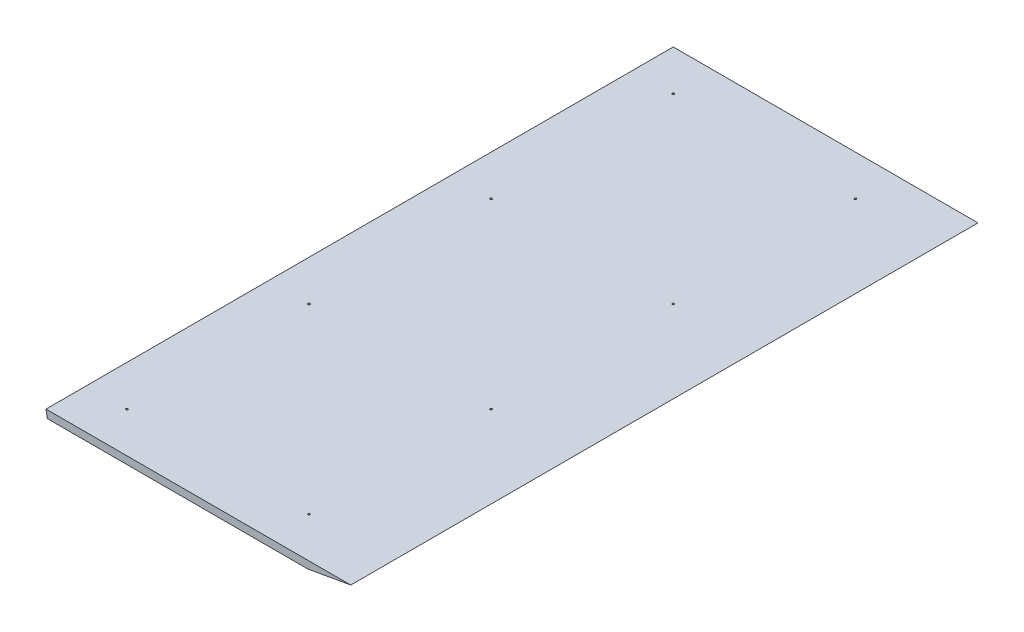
ISO-10303-21;
HEADER;
FILE_DESCRIPTION(('STEP AP214'),'2;1');
FILE_NAME('part.step','',(''),(''),'','','');
FILE_SCHEMA(('AUTOMOTIVE_DESIGN { 1 0 10303 214 1 1 1 1 }'));
ENDSEC;
DATA;
#1=APPLICATION_CONTEXT('core data for automotive mechanical design processes');
#2=APPLICATION_PROTOCOL_DEFINITION('international standard','automotive_design',2000,#1);
#3=PRODUCT_CONTEXT('',#1,'mechanical');
#4=PRODUCT('Part','Part','',(#3));
#5=PRODUCT_RELATED_PRODUCT_CATEGORY('part','',(#4));
#6=PRODUCT_DEFINITION_FORMATION('','',#4);
#7=PRODUCT_DEFINITION_CONTEXT('part definition',#1,'design');
#8=PRODUCT_DEFINITION('design','',#6,#7);
#9=PRODUCT_DEFINITION_SHAPE('','',#8);
#10=(LENGTH_UNIT() NAMED_UNIT(*) SI_UNIT(.MILLI.,.METRE.));
#11=(NAMED_UNIT(*) PLANE_ANGLE_UNIT() SI_UNIT($,.RADIAN.));
#12=(NAMED_UNIT(*) SI_UNIT($,.STERADIAN.) SOLID_ANGLE_UNIT());
#13=UNCERTAINTY_MEASURE_WITH_UNIT(LENGTH_MEASURE(1.E-05),#10,'distance_accuracy_value','');
#14=(GEOMETRIC_REPRESENTATION_CONTEXT(3) GLOBAL_UNCERTAINTY_ASSIGNED_CONTEXT((#13)) GLOBAL_UNIT_ASSIGNED_CONTEXT((#10,
#11,#12)) REPRESENTATION_CONTEXT('',''));
#15=CARTESIAN_POINT('',(0.,0.,0.));
#16=DIRECTION('',(0.,0.,1.));
#17=DIRECTION('',(1.,0.,0.));
#18=AXIS2_PLACEMENT_3D('',#15,#16,#17);
#19=CARTESIAN_POINT('',(0.,19.05,0.));
#20=DIRECTION('',(0.,0.,-1.));
#21=DIRECTION('',(-1.,0.,0.));
#22=AXIS2_PLACEMENT_3D('',#19,#20,#21);
#23=PLANE('',#22);
#24=DIRECTION('',(1.,0.,0.));
#25=VECTOR('',#24,1.);
#26=CARTESIAN_POINT('',(0.,0.,0.));
#27=LINE('',#26,#25);
#28=CARTESIAN_POINT('',(3.35902898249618,0.,0.));
#29=VERTEX_POINT('',#28);
#30=CARTESIAN_POINT('',(657.137081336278,0.,0.));
#31=VERTEX_POINT('',#30);
#32=EDGE_CURVE('E105',#29,#31,#27,.T.);
#33=ORIENTED_EDGE('',*,*,#32,.T.);
#34=DIRECTION('',(0.984807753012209,0.173648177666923,0.));
#35=VECTOR('',#34,1.);
#36=CARTESIAN_POINT('',(657.137081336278,0.,0.));
#37=LINE('',#36,#35);
#38=CARTESIAN_POINT('',(765.175,19.05,0.));
#39=VERTEX_POINT('',#38);
#40=EDGE_CURVE('E50',#31,#39,#37,.T.);
#41=ORIENTED_EDGE('',*,*,#40,.T.);
#42=DIRECTION('',(1.,0.,0.));
#43=VECTOR('',#42,1.);
#44=CARTESIAN_POINT('',(0.,19.05,0.));
#45=LINE('',#44,#43);
#46=CARTESIAN_POINT('',(0.,19.05,0.));
#47=VERTEX_POINT('',#46);
#48=EDGE_CURVE('E89',#47,#39,#45,.T.);
#49=ORIENTED_EDGE('',*,*,#48,.F.);
#50=DIRECTION('',(0.173648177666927,-0.984807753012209,0.));
#51=VECTOR('',#50,1.);
#52=CARTESIAN_POINT('',(0.,19.05,0.));
#53=LINE('',#52,#51);
#54=EDGE_CURVE('E92',#47,#29,#53,.T.);
#55=ORIENTED_EDGE('',*,*,#54,.T.);
#56=EDGE_LOOP('',(#33,#41,#49,#55));
#57=FACE_BOUND('',#56,.T.);
#58=ADVANCED_FACE('F34',(#57),#23,.F.);
#59=CARTESIAN_POINT('',(0.,19.05,-1574.8));
#60=DIRECTION('',(0.,0.,1.));
#61=DIRECTION('',(1.,0.,0.));
#62=AXIS2_PLACEMENT_3D('',#59,#60,#61);
#63=PLANE('',#62);
#64=DIRECTION('',(-1.,0.,0.));
#65=VECTOR('',#64,1.);
#66=CARTESIAN_POINT('',(0.,19.05,-1574.8));
#67=LINE('',#66,#65);
#68=CARTESIAN_POINT('',(765.175,19.05,-1574.8));
#69=VERTEX_POINT('',#68);
#70=CARTESIAN_POINT('',(0.,19.05,-1574.8));
#71=VERTEX_POINT('',#70);
#72=EDGE_CURVE('E11',#69,#71,#67,.T.);
#73=ORIENTED_EDGE('',*,*,#72,.F.);
#74=DIRECTION('',(0.984807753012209,0.173648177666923,0.));
#75=VECTOR('',#74,1.);
#76=CARTESIAN_POINT('',(657.137081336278,0.,-1574.8));
#77=LINE('',#76,#75);
#78=CARTESIAN_POINT('',(657.137081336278,0.,-1574.8));
#79=VERTEX_POINT('',#78);
#80=EDGE_CURVE('E74',#79,#69,#77,.T.);
#81=ORIENTED_EDGE('',*,*,#80,.F.);
#82=DIRECTION('',(-1.,0.,0.));
#83=VECTOR('',#82,1.);
#84=CARTESIAN_POINT('',(0.,0.,-1574.8));
#85=LINE('',#84,#83);
#86=CARTESIAN_POINT('',(3.35902898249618,0.,-1574.8));
#87=VERTEX_POINT('',#86);
#88=EDGE_CURVE('E37',#79,#87,#85,.T.);
#89=ORIENTED_EDGE('',*,*,#88,.T.);
#90=DIRECTION('',(0.173648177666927,-0.984807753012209,0.));
#91=VECTOR('',#90,1.);
#92=CARTESIAN_POINT('',(0.,19.05,-1574.8));
#93=LINE('',#92,#91);
#94=EDGE_CURVE('E58',#71,#87,#93,.T.);
#95=ORIENTED_EDGE('',*,*,#94,.F.);
#96=EDGE_LOOP('',(#73,#81,#89,#95));
#97=FACE_BOUND('',#96,.T.);
#98=ADVANCED_FACE('F91',(#97),#63,.F.);
#99=CARTESIAN_POINT('',(0.,19.05,0.));
#100=DIRECTION('',(0.,-1.,0.));
#101=DIRECTION('',(0.,0.,-1.));
#102=AXIS2_PLACEMENT_3D('',#99,#100,#101);
#103=PLANE('',#102);
#104=CARTESIAN_POINT('',(101.6,19.05,-1473.2));
#105=DIRECTION('',(0.,1.,0.));
#106=DIRECTION('',(0.,0.,1.));
#107=AXIS2_PLACEMENT_3D('',#104,#105,#106);
#108=CIRCLE('',#107,2.52729999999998);
#109=CARTESIAN_POINT('',(101.6,19.05,-1470.6727));
#110=VERTEX_POINT('',#109);
#111=EDGE_CURVE('E152',#110,#110,#108,.T.);
#112=ORIENTED_EDGE('',*,*,#111,.F.);
#113=EDGE_LOOP('',(#112));
#114=FACE_BOUND('',#113,.T.);
#115=CARTESIAN_POINT('',(558.8,19.05,-1473.2));
#116=DIRECTION('',(0.,1.,0.));
#117=DIRECTION('',(0.,0.,1.));
#118=AXIS2_PLACEMENT_3D('',#115,#116,#117);
#119=CIRCLE('',#118,2.52730000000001);
#120=CARTESIAN_POINT('',(558.8,19.05,-1470.6727));
#121=VERTEX_POINT('',#120);
#122=EDGE_CURVE('E146',#121,#121,#119,.T.);
#123=ORIENTED_EDGE('',*,*,#122,.F.);
#124=EDGE_LOOP('',(#123));
#125=FACE_BOUND('',#124,.T.);
#126=CARTESIAN_POINT('',(558.8,19.05,-1016.));
#127=DIRECTION('',(0.,1.,0.));
#128=DIRECTION('',(0.,0.,1.));
#129=AXIS2_PLACEMENT_3D('',#126,#127,#128);
#130=CIRCLE('',#129,2.52730000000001);
#131=CARTESIAN_POINT('',(558.8,19.05,-1013.4727));
#132=VERTEX_POINT('',#131);
#133=EDGE_CURVE('E140',#132,#132,#130,.T.);
#134=ORIENTED_EDGE('',*,*,#133,.F.);
#135=EDGE_LOOP('',(#134));
#136=FACE_BOUND('',#135,.T.);
#137=CARTESIAN_POINT('',(558.8,19.05,-558.8));
#138=DIRECTION('',(0.,1.,0.));
#139=DIRECTION('',(0.,0.,1.));
#140=AXIS2_PLACEMENT_3D('',#137,#138,#139);
#141=CIRCLE('',#140,2.52730000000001);
#142=CARTESIAN_POINT('',(558.8,19.05,-556.2727));
#143=VERTEX_POINT('',#142);
#144=EDGE_CURVE('E134',#143,#143,#141,.T.);
#145=ORIENTED_EDGE('',*,*,#144,.F.);
#146=EDGE_LOOP('',(#145));
#147=FACE_BOUND('',#146,.T.);
#148=CARTESIAN_POINT('',(558.8,19.05,-101.6));
#149=DIRECTION('',(0.,1.,0.));
#150=DIRECTION('',(0.,0.,1.));
#151=AXIS2_PLACEMENT_3D('',#148,#149,#150);
#152=CIRCLE('',#151,2.52730000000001);
#153=CARTESIAN_POINT('',(558.8,19.05,-99.0727));
#154=VERTEX_POINT('',#153);
#155=EDGE_CURVE('E128',#154,#154,#152,.T.);
#156=ORIENTED_EDGE('',*,*,#155,.F.);
#157=EDGE_LOOP('',(#156));
#158=FACE_BOUND('',#157,.T.);
#159=CARTESIAN_POINT('',(101.6,19.05,-101.6));
#160=DIRECTION('',(0.,1.,0.));
#161=DIRECTION('',(0.,0.,1.));
#162=AXIS2_PLACEMENT_3D('',#159,#160,#161);
#163=CIRCLE('',#162,2.52729999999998);
#164=CARTESIAN_POINT('',(101.6,19.05,-99.0727));
#165=VERTEX_POINT('',#164);
#166=EDGE_CURVE('E122',#165,#165,#163,.T.);
#167=ORIENTED_EDGE('',*,*,#166,.F.);
#168=EDGE_LOOP('',(#167));
#169=FACE_BOUND('',#168,.T.);
#170=CARTESIAN_POINT('',(101.6,19.05,-558.8));
#171=DIRECTION('',(0.,1.,0.));
#172=DIRECTION('',(0.,0.,1.));
#173=AXIS2_PLACEMENT_3D('',#170,#171,#172);
#174=CIRCLE('',#173,2.52729999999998);
#175=CARTESIAN_POINT('',(101.6,19.05,-556.2727));
#176=VERTEX_POINT('',#175);
#177=EDGE_CURVE('E116',#176,#176,#174,.T.);
#178=ORIENTED_EDGE('',*,*,#177,.F.);
#179=EDGE_LOOP('',(#178));
#180=FACE_BOUND('',#179,.T.);
#181=CARTESIAN_POINT('',(101.6,19.05,-1016.));
#182=DIRECTION('',(0.,1.,0.));
#183=DIRECTION('',(0.,0.,1.));
#184=AXIS2_PLACEMENT_3D('',#181,#182,#183);
#185=CIRCLE('',#184,2.52729999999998);
#186=CARTESIAN_POINT('',(101.6,19.05,-1013.4727));
#187=VERTEX_POINT('',#186);
#188=EDGE_CURVE('E98',#187,#187,#185,.T.);
#189=ORIENTED_EDGE('',*,*,#188,.F.);
#190=EDGE_LOOP('',(#189));
#191=FACE_BOUND('',#190,.T.);
#192=DIRECTION('',(0.,0.,1.));
#193=VECTOR('',#192,1.);
#194=CARTESIAN_POINT('',(0.,19.05,0.));
#195=LINE('',#194,#193);
#196=EDGE_CURVE('E103',#71,#47,#195,.T.);
#197=ORIENTED_EDGE('',*,*,#196,.T.);
#198=ORIENTED_EDGE('',*,*,#48,.T.);
#199=DIRECTION('',(0.,0.,-1.));
#200=VECTOR('',#199,1.);
#201=CARTESIAN_POINT('',(765.175,19.05,0.));
#202=LINE('',#201,#200);
#203=EDGE_CURVE('E42',#39,#69,#202,.T.);
#204=ORIENTED_EDGE('',*,*,#203,.T.);
#205=ORIENTED_EDGE('',*,*,#72,.T.);
#206=EDGE_LOOP('',(#197,#198,#204,#205));
#207=FACE_BOUND('',#206,.T.);
#208=ADVANCED_FACE('F87',(#114,#125,#136,#147,#158,#169,#180,#191,#207),#103,.F.);
#209=CARTESIAN_POINT('',(0.,0.,0.));
#210=DIRECTION('',(0.,-1.,0.));
#211=DIRECTION('',(0.,0.,-1.));
#212=AXIS2_PLACEMENT_3D('',#209,#210,#211);
#213=PLANE('',#212);
#214=CARTESIAN_POINT('',(101.6,0.,-1473.2));
#215=DIRECTION('',(0.,1.,0.));
#216=DIRECTION('',(0.,0.,1.));
#217=AXIS2_PLACEMENT_3D('',#214,#215,#216);
#218=CIRCLE('',#217,2.52729999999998);
#219=CARTESIAN_POINT('',(101.6,0.,-1470.6727));
#220=VERTEX_POINT('',#219);
#221=EDGE_CURVE('E149',#220,#220,#218,.T.);
#222=ORIENTED_EDGE('',*,*,#221,.T.);
#223=EDGE_LOOP('',(#222));
#224=FACE_BOUND('',#223,.T.);
#225=CARTESIAN_POINT('',(558.8,0.,-1473.2));
#226=DIRECTION('',(0.,1.,0.));
#227=DIRECTION('',(0.,0.,1.));
#228=AXIS2_PLACEMENT_3D('',#225,#226,#227);
#229=CIRCLE('',#228,2.52730000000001);
#230=CARTESIAN_POINT('',(558.8,0.,-1470.6727));
#231=VERTEX_POINT('',#230);
#232=EDGE_CURVE('E143',#231,#231,#229,.T.);
#233=ORIENTED_EDGE('',*,*,#232,.T.);
#234=EDGE_LOOP('',(#233));
#235=FACE_BOUND('',#234,.T.);
#236=CARTESIAN_POINT('',(558.8,0.,-1016.));
#237=DIRECTION('',(0.,1.,0.));
#238=DIRECTION('',(0.,0.,1.));
#239=AXIS2_PLACEMENT_3D('',#236,#237,#238);
#240=CIRCLE('',#239,2.52730000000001);
#241=CARTESIAN_POINT('',(558.8,0.,-1013.4727));
#242=VERTEX_POINT('',#241);
#243=EDGE_CURVE('E137',#242,#242,#240,.T.);
#244=ORIENTED_EDGE('',*,*,#243,.T.);
#245=EDGE_LOOP('',(#244));
#246=FACE_BOUND('',#245,.T.);
#247=CARTESIAN_POINT('',(558.8,0.,-558.8));
#248=DIRECTION('',(0.,1.,0.));
#249=DIRECTION('',(0.,0.,1.));
#250=AXIS2_PLACEMENT_3D('',#247,#248,#249);
#251=CIRCLE('',#250,2.52730000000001);
#252=CARTESIAN_POINT('',(558.8,0.,-556.2727));
#253=VERTEX_POINT('',#252);
#254=EDGE_CURVE('E131',#253,#253,#251,.T.);
#255=ORIENTED_EDGE('',*,*,#254,.T.);
#256=EDGE_LOOP('',(#255));
#257=FACE_BOUND('',#256,.T.);
#258=CARTESIAN_POINT('',(558.8,0.,-101.6));
#259=DIRECTION('',(0.,1.,0.));
#260=DIRECTION('',(0.,0.,1.));
#261=AXIS2_PLACEMENT_3D('',#258,#259,#260);
#262=CIRCLE('',#261,2.52730000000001);
#263=CARTESIAN_POINT('',(558.8,0.,-99.0727));
#264=VERTEX_POINT('',#263);
#265=EDGE_CURVE('E125',#264,#264,#262,.T.);
#266=ORIENTED_EDGE('',*,*,#265,.T.);
#267=EDGE_LOOP('',(#266));
#268=FACE_BOUND('',#267,.T.);
#269=CARTESIAN_POINT('',(101.6,0.,-101.6));
#270=DIRECTION('',(0.,1.,0.));
#271=DIRECTION('',(0.,0.,1.));
#272=AXIS2_PLACEMENT_3D('',#269,#270,#271);
#273=CIRCLE('',#272,2.52729999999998);
#274=CARTESIAN_POINT('',(101.6,0.,-99.0727));
#275=VERTEX_POINT('',#274);
#276=EDGE_CURVE('E119',#275,#275,#273,.T.);
#277=ORIENTED_EDGE('',*,*,#276,.T.);
#278=EDGE_LOOP('',(#277));
#279=FACE_BOUND('',#278,.T.);
#280=CARTESIAN_POINT('',(101.6,0.,-558.8));
#281=DIRECTION('',(0.,1.,0.));
#282=DIRECTION('',(0.,0.,1.));
#283=AXIS2_PLACEMENT_3D('',#280,#281,#282);
#284=CIRCLE('',#283,2.52729999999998);
#285=CARTESIAN_POINT('',(101.6,0.,-556.2727));
#286=VERTEX_POINT('',#285);
#287=EDGE_CURVE('E113',#286,#286,#284,.T.);
#288=ORIENTED_EDGE('',*,*,#287,.T.);
#289=EDGE_LOOP('',(#288));
#290=FACE_BOUND('',#289,.T.);
#291=CARTESIAN_POINT('',(101.6,0.,-1016.));
#292=DIRECTION('',(0.,1.,0.));
#293=DIRECTION('',(0.,0.,1.));
#294=AXIS2_PLACEMENT_3D('',#291,#292,#293);
#295=CIRCLE('',#294,2.52729999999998);
#296=CARTESIAN_POINT('',(101.6,0.,-1013.4727));
#297=VERTEX_POINT('',#296);
#298=EDGE_CURVE('E93',#297,#297,#295,.T.);
#299=ORIENTED_EDGE('',*,*,#298,.T.);
#300=EDGE_LOOP('',(#299));
#301=FACE_BOUND('',#300,.T.);
#302=DIRECTION('',(0.,0.,-1.));
#303=VECTOR('',#302,1.);
#304=CARTESIAN_POINT('',(657.137081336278,0.,0.));
#305=LINE('',#304,#303);
#306=EDGE_CURVE('E77',#31,#79,#305,.T.);
#307=ORIENTED_EDGE('',*,*,#306,.F.);
#308=ORIENTED_EDGE('',*,*,#32,.F.);
#309=DIRECTION('',(0.,0.,-1.));
#310=VECTOR('',#309,1.);
#311=CARTESIAN_POINT('',(3.35902898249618,0.,0.));
#312=LINE('',#311,#310);
#313=EDGE_CURVE('E82',#29,#87,#312,.T.);
#314=ORIENTED_EDGE('',*,*,#313,.T.);
#315=ORIENTED_EDGE('',*,*,#88,.F.);
#316=EDGE_LOOP('',(#307,#308,#314,#315));
#317=FACE_BOUND('',#316,.T.);
#318=ADVANCED_FACE('F160',(#224,#235,#246,#257,#268,#279,#290,#301,#317),#213,.T.);
#319=CARTESIAN_POINT('',(0.,19.05,0.));
#320=DIRECTION('',(0.984807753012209,0.173648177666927,0.));
#321=DIRECTION('',(-0.173648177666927,0.984807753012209,0.));
#322=AXIS2_PLACEMENT_3D('',#319,#320,#321);
#323=PLANE('',#322);
#324=ORIENTED_EDGE('',*,*,#94,.T.);
#325=ORIENTED_EDGE('',*,*,#313,.F.);
#326=ORIENTED_EDGE('',*,*,#54,.F.);
#327=ORIENTED_EDGE('',*,*,#196,.F.);
#328=EDGE_LOOP('',(#324,#325,#326,#327));
#329=FACE_BOUND('',#328,.T.);
#330=ADVANCED_FACE('F188',(#329),#323,.F.);
#331=CARTESIAN_POINT('',(657.137081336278,0.,0.));
#332=DIRECTION('',(-0.173648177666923,0.984807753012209,0.));
#333=DIRECTION('',(-0.984807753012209,-0.173648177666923,0.));
#334=AXIS2_PLACEMENT_3D('',#331,#332,#333);
#335=PLANE('',#334);
#336=ORIENTED_EDGE('',*,*,#80,.T.);
#337=ORIENTED_EDGE('',*,*,#203,.F.);
#338=ORIENTED_EDGE('',*,*,#40,.F.);
#339=ORIENTED_EDGE('',*,*,#306,.T.);
#340=EDGE_LOOP('',(#336,#337,#338,#339));
#341=FACE_BOUND('',#340,.T.);
#342=ADVANCED_FACE('F76',(#341),#335,.F.);
#343=CARTESIAN_POINT('',(101.6,19.05,-1016.));
#344=DIRECTION('',(0.,1.,0.));
#345=DIRECTION('',(0.,0.,1.));
#346=AXIS2_PLACEMENT_3D('',#343,#344,#345);
#347=CYLINDRICAL_SURFACE('',#346,2.52729999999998);
#348=ORIENTED_EDGE('',*,*,#298,.F.);
#349=EDGE_LOOP('',(#348));
#350=FACE_BOUND('',#349,.T.);
#351=ORIENTED_EDGE('',*,*,#188,.T.);
#352=EDGE_LOOP('',(#351));
#353=FACE_BOUND('',#352,.T.);
#354=ADVANCED_FACE('F176',(#350,#353),#347,.F.);
#355=CARTESIAN_POINT('',(101.6,19.05,-558.8));
#356=DIRECTION('',(0.,1.,0.));
#357=DIRECTION('',(0.,0.,1.));
#358=AXIS2_PLACEMENT_3D('',#355,#356,#357);
#359=CYLINDRICAL_SURFACE('',#358,2.52729999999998);
#360=ORIENTED_EDGE('',*,*,#287,.F.);
#361=EDGE_LOOP('',(#360));
#362=FACE_BOUND('',#361,.T.);
#363=ORIENTED_EDGE('',*,*,#177,.T.);
#364=EDGE_LOOP('',(#363));
#365=FACE_BOUND('',#364,.T.);
#366=ADVANCED_FACE('F178',(#362,#365),#359,.F.);
#367=CARTESIAN_POINT('',(101.6,19.05,-101.6));
#368=DIRECTION('',(0.,1.,0.));
#369=DIRECTION('',(0.,0.,1.));
#370=AXIS2_PLACEMENT_3D('',#367,#368,#369);
#371=CYLINDRICAL_SURFACE('',#370,2.52729999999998);
#372=ORIENTED_EDGE('',*,*,#276,.F.);
#373=EDGE_LOOP('',(#372));
#374=FACE_BOUND('',#373,.T.);
#375=ORIENTED_EDGE('',*,*,#166,.T.);
#376=EDGE_LOOP('',(#375));
#377=FACE_BOUND('',#376,.T.);
#378=ADVANCED_FACE('F185',(#374,#377),#371,.F.);
#379=CARTESIAN_POINT('',(558.8,19.05,-101.6));
#380=DIRECTION('',(0.,1.,0.));
#381=DIRECTION('',(0.,0.,1.));
#382=AXIS2_PLACEMENT_3D('',#379,#380,#381);
#383=CYLINDRICAL_SURFACE('',#382,2.52730000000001);
#384=ORIENTED_EDGE('',*,*,#265,.F.);
#385=EDGE_LOOP('',(#384));
#386=FACE_BOUND('',#385,.T.);
#387=ORIENTED_EDGE('',*,*,#155,.T.);
#388=EDGE_LOOP('',(#387));
#389=FACE_BOUND('',#388,.T.);
#390=ADVANCED_FACE('F240',(#386,#389),#383,.F.);
#391=CARTESIAN_POINT('',(558.8,19.05,-558.8));
#392=DIRECTION('',(0.,1.,0.));
#393=DIRECTION('',(0.,0.,1.));
#394=AXIS2_PLACEMENT_3D('',#391,#392,#393);
#395=CYLINDRICAL_SURFACE('',#394,2.52730000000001);
#396=ORIENTED_EDGE('',*,*,#254,.F.);
#397=EDGE_LOOP('',(#396));
#398=FACE_BOUND('',#397,.T.);
#399=ORIENTED_EDGE('',*,*,#144,.T.);
#400=EDGE_LOOP('',(#399));
#401=FACE_BOUND('',#400,.T.);
#402=ADVANCED_FACE('F250',(#398,#401),#395,.F.);
#403=CARTESIAN_POINT('',(558.8,19.05,-1016.));
#404=DIRECTION('',(0.,1.,0.));
#405=DIRECTION('',(0.,0.,1.));
#406=AXIS2_PLACEMENT_3D('',#403,#404,#405);
#407=CYLINDRICAL_SURFACE('',#406,2.52730000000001);
#408=ORIENTED_EDGE('',*,*,#243,.F.);
#409=EDGE_LOOP('',(#408));
#410=FACE_BOUND('',#409,.T.);
#411=ORIENTED_EDGE('',*,*,#133,.T.);
#412=EDGE_LOOP('',(#411));
#413=FACE_BOUND('',#412,.T.);
#414=ADVANCED_FACE('F260',(#410,#413),#407,.F.);
#415=CARTESIAN_POINT('',(558.8,19.05,-1473.2));
#416=DIRECTION('',(0.,1.,0.));
#417=DIRECTION('',(0.,0.,1.));
#418=AXIS2_PLACEMENT_3D('',#415,#416,#417);
#419=CYLINDRICAL_SURFACE('',#418,2.52730000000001);
#420=ORIENTED_EDGE('',*,*,#232,.F.);
#421=EDGE_LOOP('',(#420));
#422=FACE_BOUND('',#421,.T.);
#423=ORIENTED_EDGE('',*,*,#122,.T.);
#424=EDGE_LOOP('',(#423));
#425=FACE_BOUND('',#424,.T.);
#426=ADVANCED_FACE('F270',(#422,#425),#419,.F.);
#427=CARTESIAN_POINT('',(101.6,19.05,-1473.2));
#428=DIRECTION('',(0.,1.,0.));
#429=DIRECTION('',(0.,0.,1.));
#430=AXIS2_PLACEMENT_3D('',#427,#428,#429);
#431=CYLINDRICAL_SURFACE('',#430,2.52729999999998);
#432=ORIENTED_EDGE('',*,*,#221,.F.);
#433=EDGE_LOOP('',(#432));
#434=FACE_BOUND('',#433,.T.);
#435=ORIENTED_EDGE('',*,*,#111,.T.);
#436=EDGE_LOOP('',(#435));
#437=FACE_BOUND('',#436,.T.);
#438=ADVANCED_FACE('F156',(#434,#437),#431,.F.);
#439=CLOSED_SHELL('',(#58,#98,#208,#318,#330,#342,#354,#366,#378,#390,#402,#414,#426,#438));
#440=MANIFOLD_SOLID_BREP('B2',#439);
#441=ADVANCED_BREP_SHAPE_REPRESENTATION('',(#18,#440),#14);
#442=SHAPE_DEFINITION_REPRESENTATION(#9,#441);
ENDSEC;
END-ISO-10303-21;
